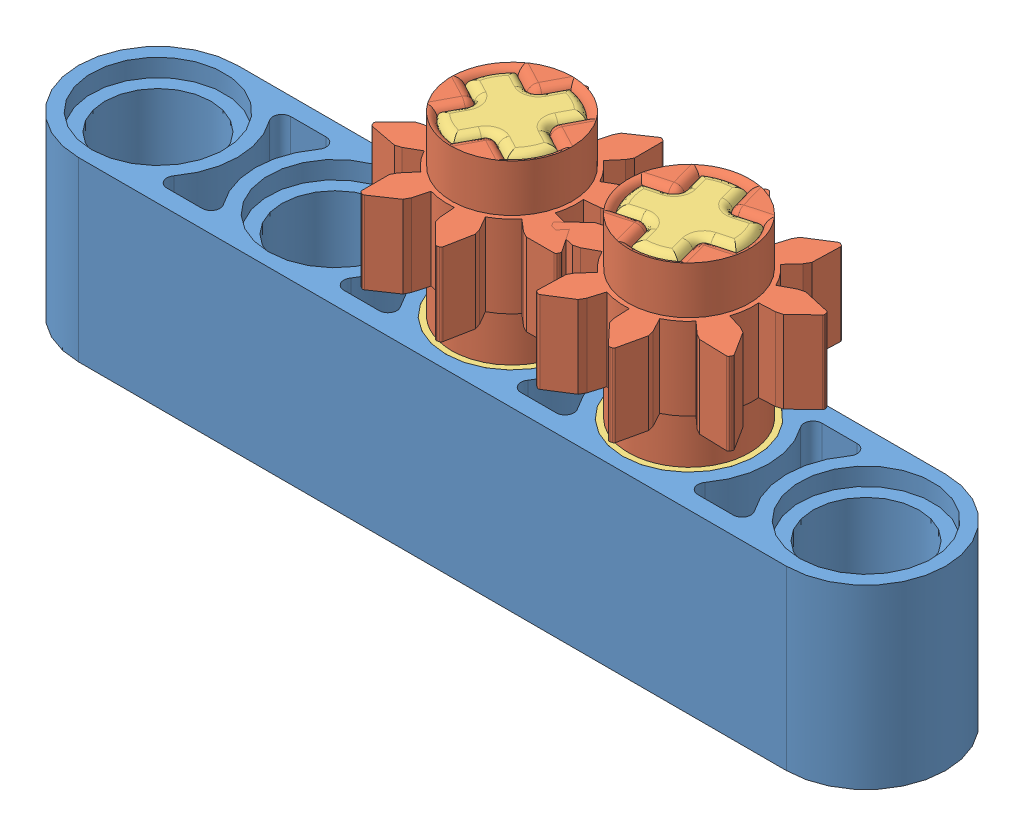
SolidWorks assembly 10.2.SLDASM, configuration Default (file format 12000). Lengths in mm.
Overall size (39.2 16 13.6).
5 component instances, 3 part files, 11 mates.
Components (placement in the parent):
- 32316 Beam 5-1: 32316 Beam 5.SLDPRT [Default] at (4.1646 19.6313 36.1738) size (39.2 8 7.2)
- 3647 Gear 8-1: 3647 Gear 8.SLDPRT [Default] at (20.1646 31.6313 36.1738) x (-0.884147 0 -0.46721) z (0.46721 0 -0.884147) size (10.06 8 10.06)
- 3749 Axle Pin without Friction Ridges Lengthwise-1: 3749 Axle Pin without Friction Ridges Lengthwise.SLDPRT [Default] at (28.1646 27.6313 36.1738) x (-0.964226 0 0.26508) z (-0.26508 0 -0.964226) size (6 16 6)
- 3647 Gear 8-2: 3647 Gear 8.SLDPRT [Default] at (28.1646 31.6313 36.1738) x (0.26508 0 0.964226) z (-0.964226 0 0.26508) size (10.06 8 10.06)
- 3749 Axle Pin without Friction Ridges Lengthwise-2: 3749 Axle Pin without Friction Ridges Lengthwise.SLDPRT [Default] at (20.1646 27.6313 36.1738) x (-0.884147 0 -0.46721) z (0.46721 0 -0.884147) size (6 16 6)
Mates (geometry in assembly coordinates):
- Concentric1: concentric anti-aligned: cylinder of 32316 Beam 5-1 through (20.1646 27.6313 36.1738) axis (0 -1 0) radius 2.4; cylinder of 3749 Axle Pin without Friction Ridges Lengthwise-2 through (20.1646 19.6313 36.1738) axis (0 1 0) radius 2.4
- Coincident1: coincident anti-aligned: plane of 32316 Beam 5-1 through (20.1646 26.8313 36.1738) normal (0 1 0); plane of 3749 Axle Pin without Friction Ridges Lengthwise-2 through (20.1646 26.8313 36.1738) normal (0 -1 0)
- Concentric2: concentric anti-aligned: cylinder of 32316 Beam 5-1 through (28.1646 27.6313 36.1738) axis (0 -1 0) radius 2.4; cylinder of 3749 Axle Pin without Friction Ridges Lengthwise-1 through (28.1646 19.6313 36.1738) axis (0 1 0) radius 2.4
- Coincident2: coincident anti-aligned: circle of 32316 Beam 5-1; plane of 3749 Axle Pin without Friction Ridges Lengthwise-1 through (28.1646 26.8313 36.1738) normal (0 -1 0)
- Concentric3: concentric anti-aligned: cylinder of 3647 Gear 8-1 through (20.1646 27.6313 36.1738) axis (0 1 0) radius 2.4; cylinder of 3749 Axle Pin without Friction Ridges Lengthwise-2 through (20.1646 35.6313 36.1738) axis (0 -1 0) radius 2.4
- Coincident3: coincident anti-aligned: plane of 3647 Gear 8-1 through (20.8852 27.6313 37.5498) normal (0.46721 0 -0.884147); plane of 3749 Axle Pin without Friction Ridges Lengthwise-2 through (17.7793 35.6313 35.9086) normal (-0.46721 0 0.884147)
- Concentric4: concentric anti-aligned: cylinder of 3749 Axle Pin without Friction Ridges Lengthwise-1 through (28.1646 35.6313 36.1738) axis (0 -1 0) radius 2.4; cylinder of 3647 Gear 8-2 through (28.1646 27.6313 36.1738) axis (0 1 0) radius 2.4
- Coincident6: coincident anti-aligned: plane of 3749 Axle Pin without Friction Ridges Lengthwise-1 through (29.605 35.6313 38.0935) normal (0.964226 0 -0.26508); plane of 3647 Gear 8-2 through (28.6738 27.6313 34.7063) normal (-0.964226 0 0.26508)
- Coincident7: coincident aligned: plane of 3749 Axle Pin without Friction Ridges Lengthwise-1 through (28.1646 35.6313 36.1738) normal (0 1 0); plane of 3647 Gear 8-2 through (28.1646 35.6313 36.1738) normal (0 1 0)
- Coincident8: coincident anti-aligned: plane of 32316 Beam 5-1 through (4.1646 27.6313 36.1738) normal (0 1 0); plane of 3647 Gear 8-1 through (20.1646 27.6313 36.1738) normal (0 -1 0)
- GearMate1: gear = 5.465 mm: circle of 3647 Gear 8-1; circle of 3647 Gear 8-2
